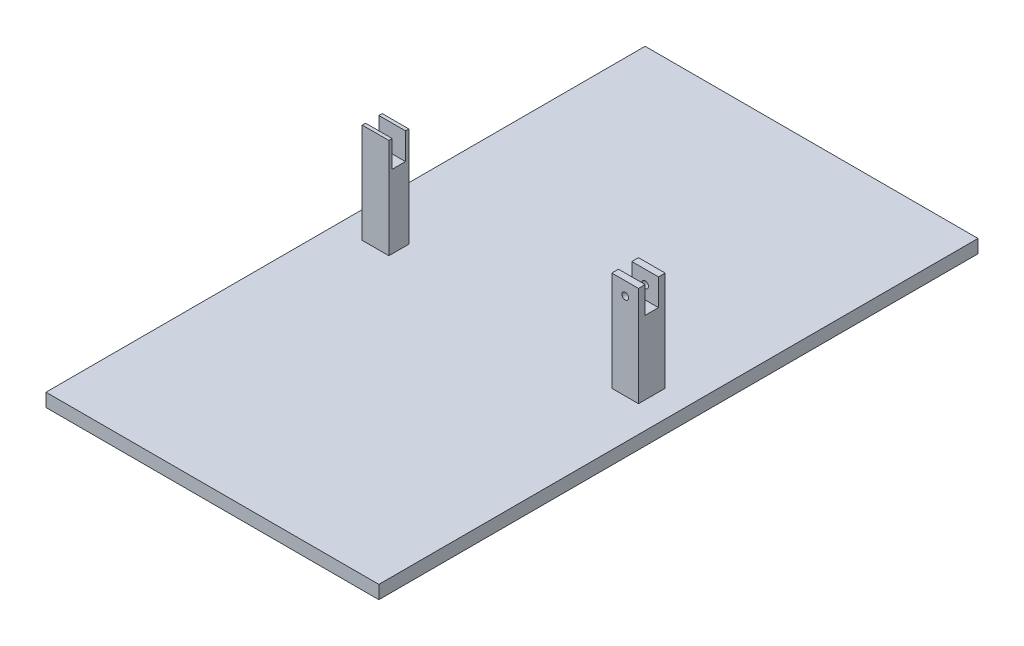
from build123d import *

# Parameters (mm, degrees)
ESQUISSE1_W             = 50
ESQUISSE1_H             = 90
BOSS_EXTRU_1_DEPTH      = 2
ESQUISSE2_W             = 4
ESQUISSE2_H             = 4
ESQUISSE2_H_2           = 3
BOSS_EXTRU_2_DEPTH      = 15
ESQUISSE3_W             = 2
ESQUISSE3_H             = 4
ENL_V_MAT_EXTRU_1_DEPTH = 67.558245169
ESQUISSE4_R             = 0.5
ENL_V_MAT_EXTRU_2_DEPTH = 56.883808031


with BuildPart() as part:
    # Esquisse1 → Boss.-Extru.1 (new body)
    with BuildSketch(Plane(origin=(0, 0, 0), x_dir=(1, 0, 0), z_dir=(0, 1, 0))):
        Rectangle(ESQUISSE1_W, ESQUISSE1_H)
    extrude(amount=BOSS_EXTRU_1_DEPTH)

    # Esquisse2 → Boss.-Extru.2 (add)
    with BuildSketch(Plane(origin=(0, 2, 0), x_dir=(1, 0, 0), z_dir=(0, 1, 0))):
        with Locations((19, 0)):
            Rectangle(ESQUISSE2_W, ESQUISSE2_H)
        with Locations((-19, 0)):
            Rectangle(ESQUISSE2_W, ESQUISSE2_H_2)
    extrude(amount=BOSS_EXTRU_2_DEPTH)

    # Esquisse3 → Enl_v. mat.-Extru.1 (cut, through all)
    with BuildSketch(Plane(origin=(21, 0, 0), x_dir=(0, 0, -1), z_dir=(1, 0, 0))):
        with Locations((0, 15)):
            Rectangle(ESQUISSE3_W, ESQUISSE3_H)
    extrude(amount=-ENL_V_MAT_EXTRU_1_DEPTH, mode=Mode.SUBTRACT)

    # Esquisse4 → Enl_v. mat.-Extru.2 (cut, through all)
    with BuildSketch(Plane.XY.offset(2)):
        with Locations((19, 15)):
            Circle(ESQUISSE4_R)
    extrude(amount=-ENL_V_MAT_EXTRU_2_DEPTH, mode=Mode.SUBTRACT)


solid = part.part
